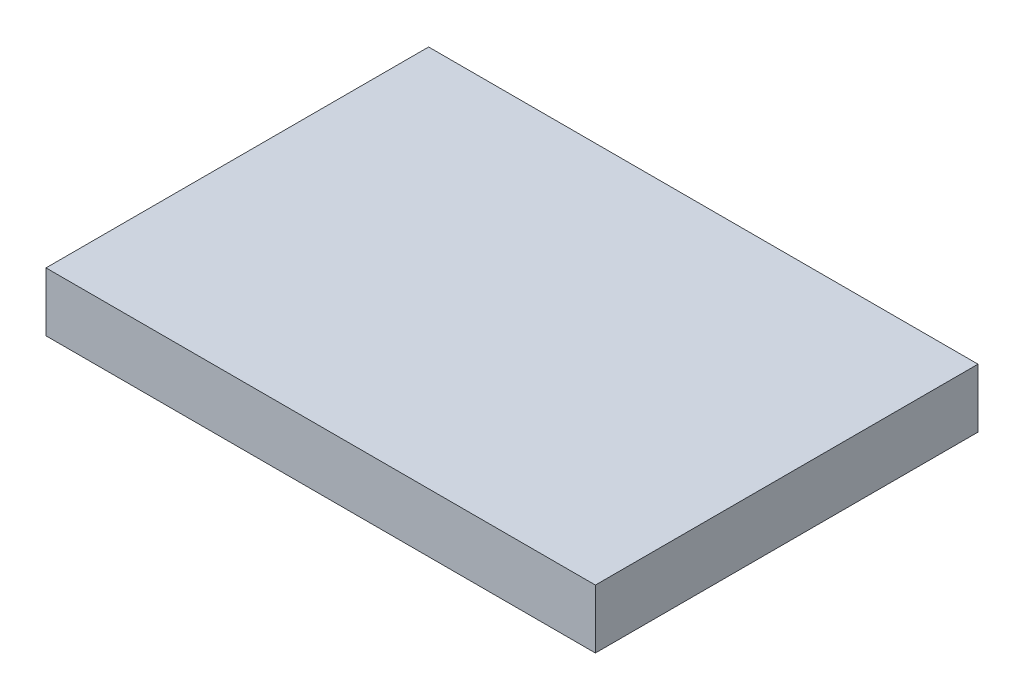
ISO-10303-21;
HEADER;
FILE_DESCRIPTION(('STEP AP214'),'2;1');
FILE_NAME('part.step','',(''),(''),'','','');
FILE_SCHEMA(('AUTOMOTIVE_DESIGN { 1 0 10303 214 1 1 1 1 }'));
ENDSEC;
DATA;
#1=APPLICATION_CONTEXT('core data for automotive mechanical design processes');
#2=APPLICATION_PROTOCOL_DEFINITION('international standard','automotive_design',2000,#1);
#3=PRODUCT_CONTEXT('',#1,'mechanical');
#4=PRODUCT('Part','Part','',(#3));
#5=PRODUCT_RELATED_PRODUCT_CATEGORY('part','',(#4));
#6=PRODUCT_DEFINITION_FORMATION('','',#4);
#7=PRODUCT_DEFINITION_CONTEXT('part definition',#1,'design');
#8=PRODUCT_DEFINITION('design','',#6,#7);
#9=PRODUCT_DEFINITION_SHAPE('','',#8);
#10=(LENGTH_UNIT() NAMED_UNIT(*) SI_UNIT(.MILLI.,.METRE.));
#11=(NAMED_UNIT(*) PLANE_ANGLE_UNIT() SI_UNIT($,.RADIAN.));
#12=(NAMED_UNIT(*) SI_UNIT($,.STERADIAN.) SOLID_ANGLE_UNIT());
#13=UNCERTAINTY_MEASURE_WITH_UNIT(LENGTH_MEASURE(1.E-05),#10,'distance_accuracy_value','');
#14=(GEOMETRIC_REPRESENTATION_CONTEXT(3) GLOBAL_UNCERTAINTY_ASSIGNED_CONTEXT((#13)) GLOBAL_UNIT_ASSIGNED_CONTEXT((#10,
#11,#12)) REPRESENTATION_CONTEXT('',''));
#15=CARTESIAN_POINT('',(0.,0.,0.));
#16=DIRECTION('',(0.,0.,1.));
#17=DIRECTION('',(1.,0.,0.));
#18=AXIS2_PLACEMENT_3D('',#15,#16,#17);
#19=CARTESIAN_POINT('',(7.112,-1.524,4.953));
#20=DIRECTION('',(1.,0.,0.));
#21=DIRECTION('',(0.,0.,-1.));
#22=AXIS2_PLACEMENT_3D('',#19,#20,#21);
#23=PLANE('',#22);
#24=DIRECTION('',(0.,0.,-1.));
#25=VECTOR('',#24,1.);
#26=CARTESIAN_POINT('',(7.112,0.,4.953));
#27=LINE('',#26,#25);
#28=CARTESIAN_POINT('',(7.112,0.,4.953));
#29=VERTEX_POINT('',#28);
#30=CARTESIAN_POINT('',(7.112,0.,-4.953));
#31=VERTEX_POINT('',#30);
#32=EDGE_CURVE('E101',#29,#31,#27,.T.);
#33=ORIENTED_EDGE('',*,*,#32,.F.);
#34=DIRECTION('',(0.,1.,0.));
#35=VECTOR('',#34,1.);
#36=CARTESIAN_POINT('',(7.112,-1.524,4.953));
#37=LINE('',#36,#35);
#38=CARTESIAN_POINT('',(7.112,-1.524,4.953));
#39=VERTEX_POINT('',#38);
#40=EDGE_CURVE('E11',#39,#29,#37,.T.);
#41=ORIENTED_EDGE('',*,*,#40,.F.);
#42=DIRECTION('',(0.,0.,-1.));
#43=VECTOR('',#42,1.);
#44=CARTESIAN_POINT('',(7.112,-1.524,4.953));
#45=LINE('',#44,#43);
#46=CARTESIAN_POINT('',(7.112,-1.524,-4.953));
#47=VERTEX_POINT('',#46);
#48=EDGE_CURVE('E95',#39,#47,#45,.T.);
#49=ORIENTED_EDGE('',*,*,#48,.T.);
#50=DIRECTION('',(0.,1.,0.));
#51=VECTOR('',#50,1.);
#52=CARTESIAN_POINT('',(7.112,-1.524,-4.953));
#53=LINE('',#52,#51);
#54=EDGE_CURVE('E40',#47,#31,#53,.T.);
#55=ORIENTED_EDGE('',*,*,#54,.T.);
#56=EDGE_LOOP('',(#33,#41,#49,#55));
#57=FACE_BOUND('',#56,.T.);
#58=ADVANCED_FACE('F37',(#57),#23,.T.);
#59=CARTESIAN_POINT('',(-7.112,-1.524,4.953));
#60=DIRECTION('',(0.,0.,1.));
#61=DIRECTION('',(1.,0.,0.));
#62=AXIS2_PLACEMENT_3D('',#59,#60,#61);
#63=PLANE('',#62);
#64=DIRECTION('',(1.,0.,0.));
#65=VECTOR('',#64,1.);
#66=CARTESIAN_POINT('',(-7.112,0.,4.953));
#67=LINE('',#66,#65);
#68=CARTESIAN_POINT('',(-7.112,0.,4.953));
#69=VERTEX_POINT('',#68);
#70=EDGE_CURVE('E97',#69,#29,#67,.T.);
#71=ORIENTED_EDGE('',*,*,#70,.F.);
#72=DIRECTION('',(0.,1.,0.));
#73=VECTOR('',#72,1.);
#74=CARTESIAN_POINT('',(-7.112,-1.524,4.953));
#75=LINE('',#74,#73);
#76=CARTESIAN_POINT('',(-7.112,-1.524,4.953));
#77=VERTEX_POINT('',#76);
#78=EDGE_CURVE('E46',#77,#69,#75,.T.);
#79=ORIENTED_EDGE('',*,*,#78,.F.);
#80=DIRECTION('',(1.,0.,0.));
#81=VECTOR('',#80,1.);
#82=CARTESIAN_POINT('',(-7.112,-1.524,4.953));
#83=LINE('',#82,#81);
#84=EDGE_CURVE('E92',#77,#39,#83,.T.);
#85=ORIENTED_EDGE('',*,*,#84,.T.);
#86=ORIENTED_EDGE('',*,*,#40,.T.);
#87=EDGE_LOOP('',(#71,#79,#85,#86));
#88=FACE_BOUND('',#87,.T.);
#89=ADVANCED_FACE('F111',(#88),#63,.T.);
#90=CARTESIAN_POINT('',(-7.112,-1.524,4.953));
#91=DIRECTION('',(-1.,0.,0.));
#92=DIRECTION('',(0.,0.,1.));
#93=AXIS2_PLACEMENT_3D('',#90,#91,#92);
#94=PLANE('',#93);
#95=DIRECTION('',(0.,0.,1.));
#96=VECTOR('',#95,1.);
#97=CARTESIAN_POINT('',(-7.112,0.,4.953));
#98=LINE('',#97,#96);
#99=CARTESIAN_POINT('',(-7.112,0.,-4.953));
#100=VERTEX_POINT('',#99);
#101=EDGE_CURVE('E87',#100,#69,#98,.T.);
#102=ORIENTED_EDGE('',*,*,#101,.F.);
#103=DIRECTION('',(0.,1.,0.));
#104=VECTOR('',#103,1.);
#105=CARTESIAN_POINT('',(-7.112,-1.524,-4.953));
#106=LINE('',#105,#104);
#107=CARTESIAN_POINT('',(-7.112,-1.524,-4.953));
#108=VERTEX_POINT('',#107);
#109=EDGE_CURVE('E82',#108,#100,#106,.T.);
#110=ORIENTED_EDGE('',*,*,#109,.F.);
#111=DIRECTION('',(0.,0.,1.));
#112=VECTOR('',#111,1.);
#113=CARTESIAN_POINT('',(-7.112,-1.524,4.953));
#114=LINE('',#113,#112);
#115=EDGE_CURVE('E85',#108,#77,#114,.T.);
#116=ORIENTED_EDGE('',*,*,#115,.T.);
#117=ORIENTED_EDGE('',*,*,#78,.T.);
#118=EDGE_LOOP('',(#102,#110,#116,#117));
#119=FACE_BOUND('',#118,.T.);
#120=ADVANCED_FACE('F84',(#119),#94,.T.);
#121=CARTESIAN_POINT('',(-7.112,-1.524,-4.953));
#122=DIRECTION('',(0.,0.,-1.));
#123=DIRECTION('',(-1.,0.,0.));
#124=AXIS2_PLACEMENT_3D('',#121,#122,#123);
#125=PLANE('',#124);
#126=DIRECTION('',(-1.,0.,0.));
#127=VECTOR('',#126,1.);
#128=CARTESIAN_POINT('',(-7.112,0.,-4.953));
#129=LINE('',#128,#127);
#130=EDGE_CURVE('E104',#31,#100,#129,.T.);
#131=ORIENTED_EDGE('',*,*,#130,.F.);
#132=ORIENTED_EDGE('',*,*,#54,.F.);
#133=DIRECTION('',(-1.,0.,0.));
#134=VECTOR('',#133,1.);
#135=CARTESIAN_POINT('',(-7.112,-1.524,-4.953));
#136=LINE('',#135,#134);
#137=EDGE_CURVE('E91',#47,#108,#136,.T.);
#138=ORIENTED_EDGE('',*,*,#137,.T.);
#139=ORIENTED_EDGE('',*,*,#109,.T.);
#140=EDGE_LOOP('',(#131,#132,#138,#139));
#141=FACE_BOUND('',#140,.T.);
#142=ADVANCED_FACE('F94',(#141),#125,.T.);
#143=CARTESIAN_POINT('',(0.,-1.524,0.));
#144=DIRECTION('',(0.,-1.,0.));
#145=DIRECTION('',(0.,0.,-1.));
#146=AXIS2_PLACEMENT_3D('',#143,#144,#145);
#147=PLANE('',#146);
#148=ORIENTED_EDGE('',*,*,#48,.F.);
#149=ORIENTED_EDGE('',*,*,#84,.F.);
#150=ORIENTED_EDGE('',*,*,#115,.F.);
#151=ORIENTED_EDGE('',*,*,#137,.F.);
#152=EDGE_LOOP('',(#148,#149,#150,#151));
#153=FACE_BOUND('',#152,.T.);
#154=ADVANCED_FACE('F90',(#153),#147,.T.);
#155=CARTESIAN_POINT('',(0.,0.,0.));
#156=DIRECTION('',(0.,-1.,0.));
#157=DIRECTION('',(0.,0.,-1.));
#158=AXIS2_PLACEMENT_3D('',#155,#156,#157);
#159=PLANE('',#158);
#160=ORIENTED_EDGE('',*,*,#32,.T.);
#161=ORIENTED_EDGE('',*,*,#130,.T.);
#162=ORIENTED_EDGE('',*,*,#101,.T.);
#163=ORIENTED_EDGE('',*,*,#70,.T.);
#164=EDGE_LOOP('',(#160,#161,#162,#163));
#165=FACE_BOUND('',#164,.T.);
#166=ADVANCED_FACE('F110',(#165),#159,.F.);
#167=CLOSED_SHELL('',(#58,#89,#120,#142,#154,#166));
#168=MANIFOLD_SOLID_BREP('B2',#167);
#169=ADVANCED_BREP_SHAPE_REPRESENTATION('',(#18,#168),#14);
#170=SHAPE_DEFINITION_REPRESENTATION(#9,#169);
ENDSEC;
END-ISO-10303-21;
